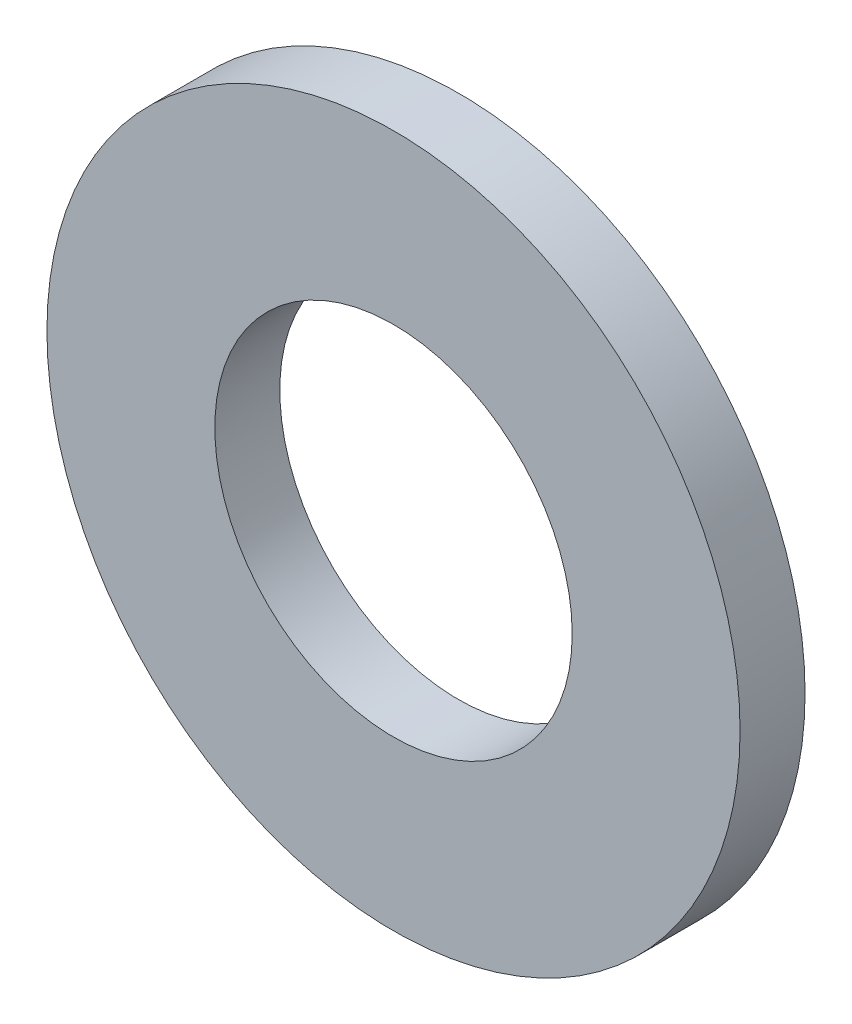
from build123d import *

# Parameters (mm, degrees)
ESQUISSE1_R      = 16
ESQUISSE1_R_2    = 8.25
EXTRUSION1_DEPTH = 3


with BuildPart() as part:
    # Esquisse1 → Extrusion1 (new body)
    with BuildSketch(Plane.XY):
        Circle(ESQUISSE1_R)
        Circle(ESQUISSE1_R_2, mode=Mode.SUBTRACT)
    extrude(amount=EXTRUSION1_DEPTH)


solid = part.part
